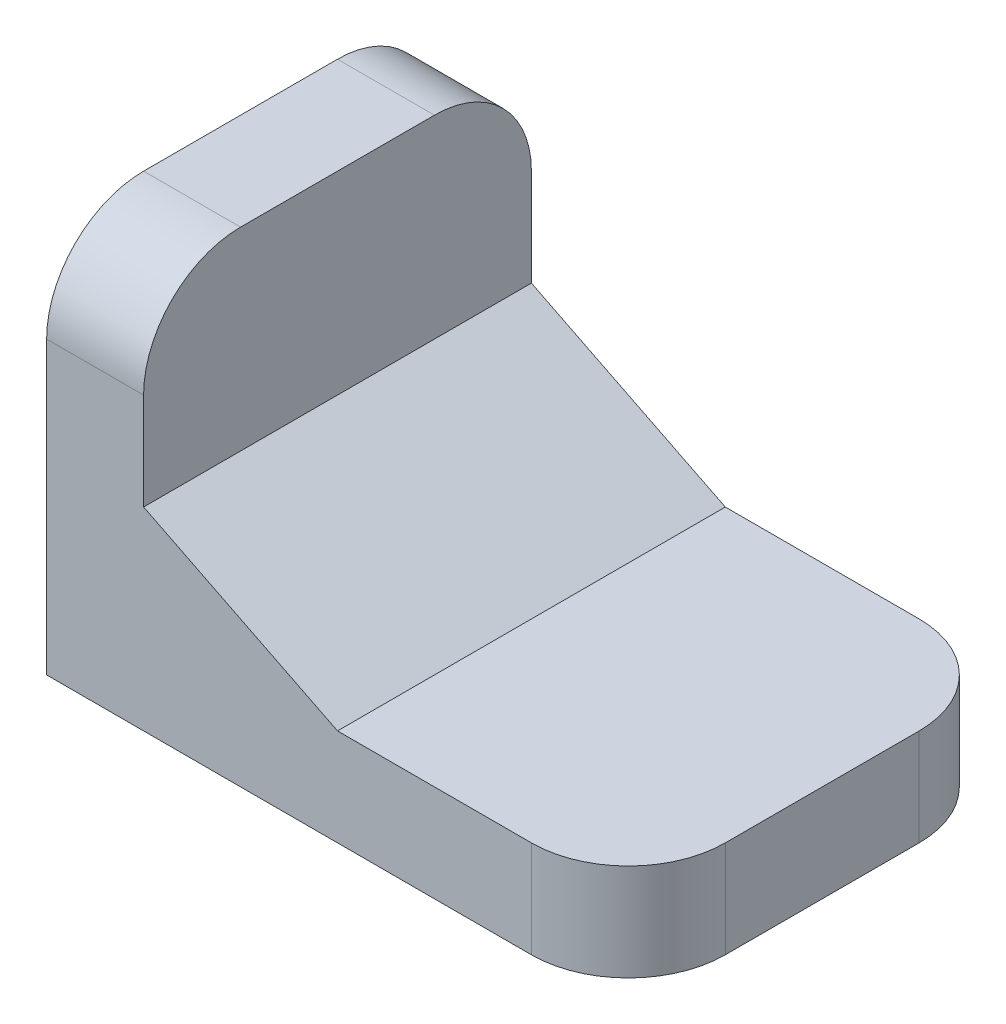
ISO-10303-21;
HEADER;
FILE_DESCRIPTION(('STEP AP214'),'2;1');
FILE_NAME('part.step','',(''),(''),'','','');
FILE_SCHEMA(('AUTOMOTIVE_DESIGN { 1 0 10303 214 1 1 1 1 }'));
ENDSEC;
DATA;
#1=APPLICATION_CONTEXT('core data for automotive mechanical design processes');
#2=APPLICATION_PROTOCOL_DEFINITION('international standard','automotive_design',2000,#1);
#3=PRODUCT_CONTEXT('',#1,'mechanical');
#4=PRODUCT('Part','Part','',(#3));
#5=PRODUCT_RELATED_PRODUCT_CATEGORY('part','',(#4));
#6=PRODUCT_DEFINITION_FORMATION('','',#4);
#7=PRODUCT_DEFINITION_CONTEXT('part definition',#1,'design');
#8=PRODUCT_DEFINITION('design','',#6,#7);
#9=PRODUCT_DEFINITION_SHAPE('','',#8);
#10=(LENGTH_UNIT() NAMED_UNIT(*) SI_UNIT(.MILLI.,.METRE.));
#11=(NAMED_UNIT(*) PLANE_ANGLE_UNIT() SI_UNIT($,.RADIAN.));
#12=(NAMED_UNIT(*) SI_UNIT($,.STERADIAN.) SOLID_ANGLE_UNIT());
#13=UNCERTAINTY_MEASURE_WITH_UNIT(LENGTH_MEASURE(1.E-05),#10,'distance_accuracy_value','');
#14=(GEOMETRIC_REPRESENTATION_CONTEXT(3) GLOBAL_UNCERTAINTY_ASSIGNED_CONTEXT((#13)) GLOBAL_UNIT_ASSIGNED_CONTEXT((#10,
#11,#12)) REPRESENTATION_CONTEXT('',''));
#15=CARTESIAN_POINT('',(0.,0.,0.));
#16=DIRECTION('',(0.,0.,1.));
#17=DIRECTION('',(1.,0.,0.));
#18=AXIS2_PLACEMENT_3D('',#15,#16,#17);
#19=CARTESIAN_POINT('',(60.,0.,20.));
#20=DIRECTION('',(0.,1.,0.));
#21=DIRECTION('',(-1.,0.,0.));
#22=AXIS2_PLACEMENT_3D('',#19,#20,#21);
#23=PLANE('',#22);
#24=DIRECTION('',(1.,0.,0.));
#25=VECTOR('',#24,1.);
#26=CARTESIAN_POINT('',(60.,0.,-20.));
#27=LINE('',#26,#25);
#28=CARTESIAN_POINT('',(0.,0.,-20.));
#29=VERTEX_POINT('',#28);
#30=CARTESIAN_POINT('',(50.,0.,-20.));
#31=VERTEX_POINT('',#30);
#32=EDGE_CURVE('E148',#29,#31,#27,.T.);
#33=ORIENTED_EDGE('',*,*,#32,.T.);
#34=CARTESIAN_POINT('',(50.,0.,-10.));
#35=DIRECTION('',(0.,1.,0.));
#36=DIRECTION('',(-1.,0.,0.));
#37=AXIS2_PLACEMENT_3D('',#34,#35,#36);
#38=CIRCLE('',#37,10.);
#39=CARTESIAN_POINT('',(60.,0.,-10.));
#40=VERTEX_POINT('',#39);
#41=EDGE_CURVE('E185',#31,#40,#38,.F.);
#42=ORIENTED_EDGE('',*,*,#41,.T.);
#43=DIRECTION('',(0.,0.,-1.));
#44=VECTOR('',#43,1.);
#45=CARTESIAN_POINT('',(60.,0.,20.));
#46=LINE('',#45,#44);
#47=CARTESIAN_POINT('',(60.,0.,10.));
#48=VERTEX_POINT('',#47);
#49=EDGE_CURVE('E167',#48,#40,#46,.T.);
#50=ORIENTED_EDGE('',*,*,#49,.F.);
#51=CARTESIAN_POINT('',(50.,0.,10.));
#52=DIRECTION('',(0.,1.,0.));
#53=DIRECTION('',(-1.,0.,0.));
#54=AXIS2_PLACEMENT_3D('',#51,#52,#53);
#55=CIRCLE('',#54,10.);
#56=CARTESIAN_POINT('',(50.,0.,20.));
#57=VERTEX_POINT('',#56);
#58=EDGE_CURVE('E183',#48,#57,#55,.F.);
#59=ORIENTED_EDGE('',*,*,#58,.T.);
#60=DIRECTION('',(1.,0.,0.));
#61=VECTOR('',#60,1.);
#62=CARTESIAN_POINT('',(60.,0.,20.));
#63=LINE('',#62,#61);
#64=CARTESIAN_POINT('',(0.,0.,20.));
#65=VERTEX_POINT('',#64);
#66=EDGE_CURVE('E124',#65,#57,#63,.T.);
#67=ORIENTED_EDGE('',*,*,#66,.F.);
#68=DIRECTION('',(0.,0.,-1.));
#69=VECTOR('',#68,1.);
#70=CARTESIAN_POINT('',(0.,0.,20.));
#71=LINE('',#70,#69);
#72=EDGE_CURVE('E147',#65,#29,#71,.T.);
#73=ORIENTED_EDGE('',*,*,#72,.T.);
#74=EDGE_LOOP('',(#33,#42,#50,#59,#67,#73));
#75=FACE_BOUND('',#74,.T.);
#76=ADVANCED_FACE('F30',(#75),#23,.F.);
#77=CARTESIAN_POINT('',(60.,10.,20.));
#78=DIRECTION('',(-1.,0.,0.));
#79=DIRECTION('',(0.,0.,1.));
#80=AXIS2_PLACEMENT_3D('',#77,#78,#79);
#81=PLANE('',#80);
#82=ORIENTED_EDGE('',*,*,#49,.T.);
#83=DIRECTION('',(0.,1.,0.));
#84=VECTOR('',#83,1.);
#85=CARTESIAN_POINT('',(60.,10.,-10.));
#86=LINE('',#85,#84);
#87=CARTESIAN_POINT('',(60.,10.,-10.));
#88=VERTEX_POINT('',#87);
#89=EDGE_CURVE('E172',#40,#88,#86,.T.);
#90=ORIENTED_EDGE('',*,*,#89,.T.);
#91=DIRECTION('',(0.,0.,-1.));
#92=VECTOR('',#91,1.);
#93=CARTESIAN_POINT('',(60.,10.,20.));
#94=LINE('',#93,#92);
#95=CARTESIAN_POINT('',(60.,10.,10.));
#96=VERTEX_POINT('',#95);
#97=EDGE_CURVE('E134',#96,#88,#94,.T.);
#98=ORIENTED_EDGE('',*,*,#97,.F.);
#99=DIRECTION('',(0.,1.,0.));
#100=VECTOR('',#99,1.);
#101=CARTESIAN_POINT('',(60.,10.,10.));
#102=LINE('',#101,#100);
#103=EDGE_CURVE('E170',#96,#48,#102,.F.);
#104=ORIENTED_EDGE('',*,*,#103,.T.);
#105=EDGE_LOOP('',(#82,#90,#98,#104));
#106=FACE_BOUND('',#105,.T.);
#107=ADVANCED_FACE('F226',(#106),#81,.F.);
#108=CARTESIAN_POINT('',(30.,10.,20.));
#109=DIRECTION('',(0.,-1.,0.));
#110=DIRECTION('',(1.,0.,0.));
#111=AXIS2_PLACEMENT_3D('',#108,#109,#110);
#112=PLANE('',#111);
#113=ORIENTED_EDGE('',*,*,#97,.T.);
#114=CARTESIAN_POINT('',(50.,10.,-10.));
#115=DIRECTION('',(0.,-1.,0.));
#116=DIRECTION('',(1.,0.,0.));
#117=AXIS2_PLACEMENT_3D('',#114,#115,#116);
#118=CIRCLE('',#117,10.);
#119=CARTESIAN_POINT('',(50.,10.,-20.));
#120=VERTEX_POINT('',#119);
#121=EDGE_CURVE('E177',#88,#120,#118,.F.);
#122=ORIENTED_EDGE('',*,*,#121,.T.);
#123=DIRECTION('',(-1.,0.,0.));
#124=VECTOR('',#123,1.);
#125=CARTESIAN_POINT('',(30.,10.,-20.));
#126=LINE('',#125,#124);
#127=CARTESIAN_POINT('',(30.,10.,-20.));
#128=VERTEX_POINT('',#127);
#129=EDGE_CURVE('E131',#120,#128,#126,.T.);
#130=ORIENTED_EDGE('',*,*,#129,.T.);
#131=DIRECTION('',(0.,0.,-1.));
#132=VECTOR('',#131,1.);
#133=CARTESIAN_POINT('',(30.,10.,20.));
#134=LINE('',#133,#132);
#135=CARTESIAN_POINT('',(30.,10.,20.));
#136=VERTEX_POINT('',#135);
#137=EDGE_CURVE('E127',#136,#128,#134,.T.);
#138=ORIENTED_EDGE('',*,*,#137,.F.);
#139=DIRECTION('',(-1.,0.,0.));
#140=VECTOR('',#139,1.);
#141=CARTESIAN_POINT('',(30.,10.,20.));
#142=LINE('',#141,#140);
#143=CARTESIAN_POINT('',(50.,10.,20.));
#144=VERTEX_POINT('',#143);
#145=EDGE_CURVE('E113',#144,#136,#142,.T.);
#146=ORIENTED_EDGE('',*,*,#145,.F.);
#147=CARTESIAN_POINT('',(50.,10.,10.));
#148=DIRECTION('',(0.,-1.,0.));
#149=DIRECTION('',(1.,0.,0.));
#150=AXIS2_PLACEMENT_3D('',#147,#148,#149);
#151=CIRCLE('',#150,10.);
#152=EDGE_CURVE('E175',#144,#96,#151,.F.);
#153=ORIENTED_EDGE('',*,*,#152,.T.);
#154=EDGE_LOOP('',(#113,#122,#130,#138,#146,#153));
#155=FACE_BOUND('',#154,.T.);
#156=ADVANCED_FACE('F129',(#155),#112,.F.);
#157=CARTESIAN_POINT('',(10.,20.,20.));
#158=DIRECTION('',(-0.447213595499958,-0.894427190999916,0.));
#159=DIRECTION('',(0.894427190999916,-0.447213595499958,0.));
#160=AXIS2_PLACEMENT_3D('',#157,#158,#159);
#161=PLANE('',#160);
#162=DIRECTION('',(-0.894427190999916,0.447213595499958,0.));
#163=VECTOR('',#162,1.);
#164=CARTESIAN_POINT('',(10.,20.,-20.));
#165=LINE('',#164,#163);
#166=CARTESIAN_POINT('',(10.,20.,-20.));
#167=VERTEX_POINT('',#166);
#168=EDGE_CURVE('E152',#128,#167,#165,.T.);
#169=ORIENTED_EDGE('',*,*,#168,.T.);
#170=DIRECTION('',(0.,0.,-1.));
#171=VECTOR('',#170,1.);
#172=CARTESIAN_POINT('',(10.,20.,20.));
#173=LINE('',#172,#171);
#174=CARTESIAN_POINT('',(10.,20.,20.));
#175=VERTEX_POINT('',#174);
#176=EDGE_CURVE('E135',#175,#167,#173,.T.);
#177=ORIENTED_EDGE('',*,*,#176,.F.);
#178=DIRECTION('',(-0.894427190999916,0.447213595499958,0.));
#179=VECTOR('',#178,1.);
#180=CARTESIAN_POINT('',(10.,20.,20.));
#181=LINE('',#180,#179);
#182=EDGE_CURVE('E119',#136,#175,#181,.T.);
#183=ORIENTED_EDGE('',*,*,#182,.F.);
#184=ORIENTED_EDGE('',*,*,#137,.T.);
#185=EDGE_LOOP('',(#169,#177,#183,#184));
#186=FACE_BOUND('',#185,.T.);
#187=ADVANCED_FACE('F137',(#186),#161,.F.);
#188=CARTESIAN_POINT('',(10.,40.,20.));
#189=DIRECTION('',(-1.,0.,0.));
#190=DIRECTION('',(0.,-1.,0.));
#191=AXIS2_PLACEMENT_3D('',#188,#189,#190);
#192=PLANE('',#191);
#193=DIRECTION('',(0.,1.,0.));
#194=VECTOR('',#193,1.);
#195=CARTESIAN_POINT('',(10.,40.,-20.));
#196=LINE('',#195,#194);
#197=CARTESIAN_POINT('',(10.,30.,-20.));
#198=VERTEX_POINT('',#197);
#199=EDGE_CURVE('E154',#167,#198,#196,.T.);
#200=ORIENTED_EDGE('',*,*,#199,.T.);
#201=CARTESIAN_POINT('',(10.,30.,-10.));
#202=DIRECTION('',(-1.,0.,0.));
#203=DIRECTION('',(0.,-1.,0.));
#204=AXIS2_PLACEMENT_3D('',#201,#202,#203);
#205=CIRCLE('',#204,10.);
#206=CARTESIAN_POINT('',(10.,40.,-10.));
#207=VERTEX_POINT('',#206);
#208=EDGE_CURVE('E11',#198,#207,#205,.F.);
#209=ORIENTED_EDGE('',*,*,#208,.T.);
#210=DIRECTION('',(0.,0.,-1.));
#211=VECTOR('',#210,1.);
#212=CARTESIAN_POINT('',(10.,40.,20.));
#213=LINE('',#212,#211);
#214=CARTESIAN_POINT('',(10.,40.,10.));
#215=VERTEX_POINT('',#214);
#216=EDGE_CURVE('E163',#215,#207,#213,.T.);
#217=ORIENTED_EDGE('',*,*,#216,.F.);
#218=CARTESIAN_POINT('',(10.,30.,10.));
#219=DIRECTION('',(-1.,0.,0.));
#220=DIRECTION('',(0.,-1.,0.));
#221=AXIS2_PLACEMENT_3D('',#218,#219,#220);
#222=CIRCLE('',#221,10.);
#223=CARTESIAN_POINT('',(10.,30.,20.));
#224=VERTEX_POINT('',#223);
#225=EDGE_CURVE('E38',#215,#224,#222,.F.);
#226=ORIENTED_EDGE('',*,*,#225,.T.);
#227=DIRECTION('',(0.,1.,0.));
#228=VECTOR('',#227,1.);
#229=CARTESIAN_POINT('',(10.,40.,20.));
#230=LINE('',#229,#228);
#231=EDGE_CURVE('E140',#175,#224,#230,.T.);
#232=ORIENTED_EDGE('',*,*,#231,.F.);
#233=ORIENTED_EDGE('',*,*,#176,.T.);
#234=EDGE_LOOP('',(#200,#209,#217,#226,#232,#233));
#235=FACE_BOUND('',#234,.T.);
#236=ADVANCED_FACE('F199',(#235),#192,.F.);
#237=CARTESIAN_POINT('',(0.,40.,20.));
#238=DIRECTION('',(0.,-1.,0.));
#239=DIRECTION('',(0.,0.,-1.));
#240=AXIS2_PLACEMENT_3D('',#237,#238,#239);
#241=PLANE('',#240);
#242=ORIENTED_EDGE('',*,*,#216,.T.);
#243=DIRECTION('',(-1.,0.,0.));
#244=VECTOR('',#243,1.);
#245=CARTESIAN_POINT('',(0.,40.,-10.));
#246=LINE('',#245,#244);
#247=CARTESIAN_POINT('',(0.,40.,-10.));
#248=VERTEX_POINT('',#247);
#249=EDGE_CURVE('E192',#207,#248,#246,.T.);
#250=ORIENTED_EDGE('',*,*,#249,.T.);
#251=DIRECTION('',(0.,0.,-1.));
#252=VECTOR('',#251,1.);
#253=CARTESIAN_POINT('',(0.,40.,20.));
#254=LINE('',#253,#252);
#255=CARTESIAN_POINT('',(0.,40.,10.));
#256=VERTEX_POINT('',#255);
#257=EDGE_CURVE('E160',#256,#248,#254,.T.);
#258=ORIENTED_EDGE('',*,*,#257,.F.);
#259=DIRECTION('',(-1.,0.,0.));
#260=VECTOR('',#259,1.);
#261=CARTESIAN_POINT('',(0.,40.,10.));
#262=LINE('',#261,#260);
#263=EDGE_CURVE('E50',#256,#215,#262,.F.);
#264=ORIENTED_EDGE('',*,*,#263,.T.);
#265=EDGE_LOOP('',(#242,#250,#258,#264));
#266=FACE_BOUND('',#265,.T.);
#267=ADVANCED_FACE('F206',(#266),#241,.F.);
#268=CARTESIAN_POINT('',(0.,0.,20.));
#269=DIRECTION('',(1.,0.,0.));
#270=DIRECTION('',(0.,0.,-1.));
#271=AXIS2_PLACEMENT_3D('',#268,#269,#270);
#272=PLANE('',#271);
#273=ORIENTED_EDGE('',*,*,#257,.T.);
#274=CARTESIAN_POINT('',(0.,30.,-10.));
#275=DIRECTION('',(1.,0.,0.));
#276=DIRECTION('',(0.,0.,-1.));
#277=AXIS2_PLACEMENT_3D('',#274,#275,#276);
#278=CIRCLE('',#277,10.);
#279=CARTESIAN_POINT('',(0.,30.,-20.));
#280=VERTEX_POINT('',#279);
#281=EDGE_CURVE('E197',#248,#280,#278,.F.);
#282=ORIENTED_EDGE('',*,*,#281,.T.);
#283=DIRECTION('',(0.,-1.,0.));
#284=VECTOR('',#283,1.);
#285=CARTESIAN_POINT('',(0.,0.,-20.));
#286=LINE('',#285,#284);
#287=EDGE_CURVE('E156',#280,#29,#286,.T.);
#288=ORIENTED_EDGE('',*,*,#287,.T.);
#289=ORIENTED_EDGE('',*,*,#72,.F.);
#290=DIRECTION('',(0.,-1.,0.));
#291=VECTOR('',#290,1.);
#292=CARTESIAN_POINT('',(0.,0.,20.));
#293=LINE('',#292,#291);
#294=CARTESIAN_POINT('',(0.,30.,20.));
#295=VERTEX_POINT('',#294);
#296=EDGE_CURVE('E142',#295,#65,#293,.T.);
#297=ORIENTED_EDGE('',*,*,#296,.F.);
#298=CARTESIAN_POINT('',(0.,30.,10.));
#299=DIRECTION('',(1.,0.,0.));
#300=DIRECTION('',(0.,0.,-1.));
#301=AXIS2_PLACEMENT_3D('',#298,#299,#300);
#302=CIRCLE('',#301,10.);
#303=EDGE_CURVE('E195',#295,#256,#302,.F.);
#304=ORIENTED_EDGE('',*,*,#303,.T.);
#305=EDGE_LOOP('',(#273,#282,#288,#289,#297,#304));
#306=FACE_BOUND('',#305,.T.);
#307=ADVANCED_FACE('F204',(#306),#272,.F.);
#308=CARTESIAN_POINT('',(0.,0.,20.));
#309=DIRECTION('',(0.,0.,-1.));
#310=DIRECTION('',(-1.,0.,0.));
#311=AXIS2_PLACEMENT_3D('',#308,#309,#310);
#312=PLANE('',#311);
#313=ORIENTED_EDGE('',*,*,#66,.T.);
#314=DIRECTION('',(0.,1.,0.));
#315=VECTOR('',#314,1.);
#316=CARTESIAN_POINT('',(50.,0.,20.));
#317=LINE('',#316,#315);
#318=EDGE_CURVE('E122',#57,#144,#317,.T.);
#319=ORIENTED_EDGE('',*,*,#318,.T.);
#320=ORIENTED_EDGE('',*,*,#145,.T.);
#321=ORIENTED_EDGE('',*,*,#182,.T.);
#322=ORIENTED_EDGE('',*,*,#231,.T.);
#323=DIRECTION('',(-1.,0.,0.));
#324=VECTOR('',#323,1.);
#325=CARTESIAN_POINT('',(0.,30.,20.));
#326=LINE('',#325,#324);
#327=EDGE_CURVE('E187',#224,#295,#326,.T.);
#328=ORIENTED_EDGE('',*,*,#327,.T.);
#329=ORIENTED_EDGE('',*,*,#296,.T.);
#330=EDGE_LOOP('',(#313,#319,#320,#321,#322,#328,#329));
#331=FACE_BOUND('',#330,.T.);
#332=ADVANCED_FACE('F116',(#331),#312,.F.);
#333=CARTESIAN_POINT('',(0.,0.,-20.));
#334=DIRECTION('',(0.,0.,-1.));
#335=DIRECTION('',(-1.,0.,0.));
#336=AXIS2_PLACEMENT_3D('',#333,#334,#335);
#337=PLANE('',#336);
#338=ORIENTED_EDGE('',*,*,#129,.F.);
#339=DIRECTION('',(0.,1.,0.));
#340=VECTOR('',#339,1.);
#341=CARTESIAN_POINT('',(50.,0.,-20.));
#342=LINE('',#341,#340);
#343=EDGE_CURVE('E181',#120,#31,#342,.F.);
#344=ORIENTED_EDGE('',*,*,#343,.T.);
#345=ORIENTED_EDGE('',*,*,#32,.F.);
#346=ORIENTED_EDGE('',*,*,#287,.F.);
#347=DIRECTION('',(-1.,0.,0.));
#348=VECTOR('',#347,1.);
#349=CARTESIAN_POINT('',(10.,30.,-20.));
#350=LINE('',#349,#348);
#351=EDGE_CURVE('E179',#280,#198,#350,.F.);
#352=ORIENTED_EDGE('',*,*,#351,.T.);
#353=ORIENTED_EDGE('',*,*,#199,.F.);
#354=ORIENTED_EDGE('',*,*,#168,.F.);
#355=EDGE_LOOP('',(#338,#344,#345,#346,#352,#353,#354));
#356=FACE_BOUND('',#355,.T.);
#357=ADVANCED_FACE('F214',(#356),#337,.T.);
#358=CARTESIAN_POINT('',(50.,10.,-10.));
#359=DIRECTION('',(0.,-1.,0.));
#360=DIRECTION('',(0.,0.,-1.));
#361=AXIS2_PLACEMENT_3D('',#358,#359,#360);
#362=CYLINDRICAL_SURFACE('',#361,10.);
#363=ORIENTED_EDGE('',*,*,#41,.F.);
#364=ORIENTED_EDGE('',*,*,#343,.F.);
#365=ORIENTED_EDGE('',*,*,#121,.F.);
#366=ORIENTED_EDGE('',*,*,#89,.F.);
#367=EDGE_LOOP('',(#363,#364,#365,#366));
#368=FACE_BOUND('',#367,.T.);
#369=ADVANCED_FACE('F223',(#368),#362,.T.);
#370=CARTESIAN_POINT('',(50.,0.,10.));
#371=DIRECTION('',(0.,1.,0.));
#372=DIRECTION('',(0.,0.,1.));
#373=AXIS2_PLACEMENT_3D('',#370,#371,#372);
#374=CYLINDRICAL_SURFACE('',#373,10.);
#375=ORIENTED_EDGE('',*,*,#58,.F.);
#376=ORIENTED_EDGE('',*,*,#103,.F.);
#377=ORIENTED_EDGE('',*,*,#152,.F.);
#378=ORIENTED_EDGE('',*,*,#318,.F.);
#379=EDGE_LOOP('',(#375,#376,#377,#378));
#380=FACE_BOUND('',#379,.T.);
#381=ADVANCED_FACE('F230',(#380),#374,.T.);
#382=CARTESIAN_POINT('',(0.,30.,-10.));
#383=DIRECTION('',(1.,0.,0.));
#384=DIRECTION('',(0.,0.,-1.));
#385=AXIS2_PLACEMENT_3D('',#382,#383,#384);
#386=CYLINDRICAL_SURFACE('',#385,10.);
#387=ORIENTED_EDGE('',*,*,#208,.F.);
#388=ORIENTED_EDGE('',*,*,#351,.F.);
#389=ORIENTED_EDGE('',*,*,#281,.F.);
#390=ORIENTED_EDGE('',*,*,#249,.F.);
#391=EDGE_LOOP('',(#387,#388,#389,#390));
#392=FACE_BOUND('',#391,.T.);
#393=ADVANCED_FACE('F209',(#392),#386,.T.);
#394=CARTESIAN_POINT('',(0.,30.,10.));
#395=DIRECTION('',(-1.,0.,0.));
#396=DIRECTION('',(0.,0.,1.));
#397=AXIS2_PLACEMENT_3D('',#394,#395,#396);
#398=CYLINDRICAL_SURFACE('',#397,10.);
#399=ORIENTED_EDGE('',*,*,#225,.F.);
#400=ORIENTED_EDGE('',*,*,#263,.F.);
#401=ORIENTED_EDGE('',*,*,#303,.F.);
#402=ORIENTED_EDGE('',*,*,#327,.F.);
#403=EDGE_LOOP('',(#399,#400,#401,#402));
#404=FACE_BOUND('',#403,.T.);
#405=ADVANCED_FACE('F32',(#404),#398,.T.);
#406=CLOSED_SHELL('',(#76,#107,#156,#187,#236,#267,#307,#332,#357,#369,#381,#393,#405));
#407=MANIFOLD_SOLID_BREP('B2',#406);
#408=ADVANCED_BREP_SHAPE_REPRESENTATION('',(#18,#407),#14);
#409=SHAPE_DEFINITION_REPRESENTATION(#9,#408);
ENDSEC;
END-ISO-10303-21;
